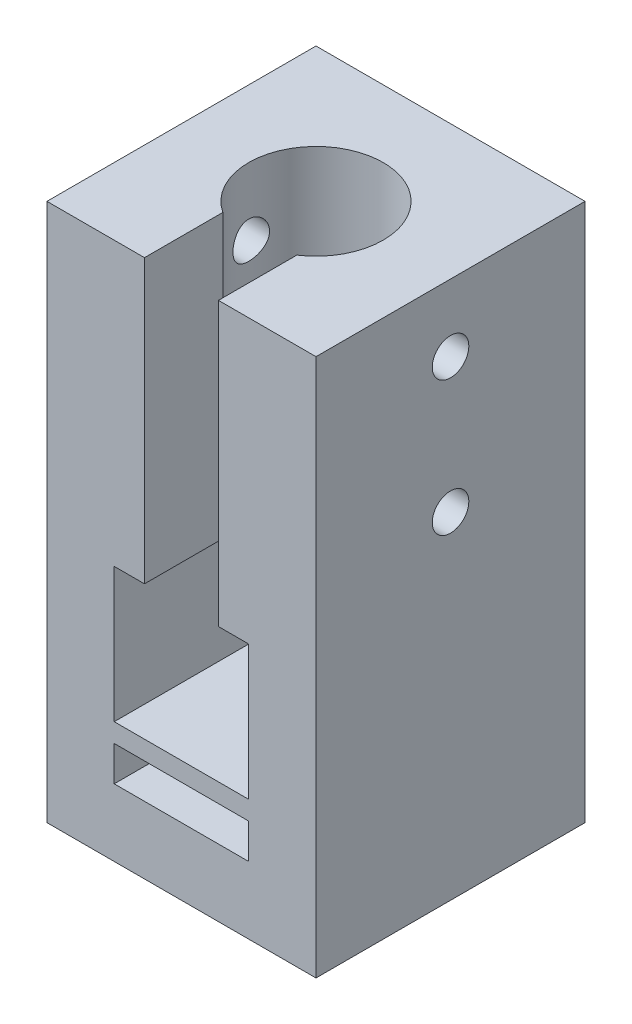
ISO-10303-21;
HEADER;
FILE_DESCRIPTION(('STEP AP214'),'2;1');
FILE_NAME('part.step','',(''),(''),'','','');
FILE_SCHEMA(('AUTOMOTIVE_DESIGN { 1 0 10303 214 1 1 1 1 }'));
ENDSEC;
DATA;
#1=APPLICATION_CONTEXT('core data for automotive mechanical design processes');
#2=APPLICATION_PROTOCOL_DEFINITION('international standard','automotive_design',2000,#1);
#3=PRODUCT_CONTEXT('',#1,'mechanical');
#4=PRODUCT('Part','Part','',(#3));
#5=PRODUCT_RELATED_PRODUCT_CATEGORY('part','',(#4));
#6=PRODUCT_DEFINITION_FORMATION('','',#4);
#7=PRODUCT_DEFINITION_CONTEXT('part definition',#1,'design');
#8=PRODUCT_DEFINITION('design','',#6,#7);
#9=PRODUCT_DEFINITION_SHAPE('','',#8);
#10=(LENGTH_UNIT() NAMED_UNIT(*) SI_UNIT(.MILLI.,.METRE.));
#11=(NAMED_UNIT(*) PLANE_ANGLE_UNIT() SI_UNIT($,.RADIAN.));
#12=(NAMED_UNIT(*) SI_UNIT($,.STERADIAN.) SOLID_ANGLE_UNIT());
#13=UNCERTAINTY_MEASURE_WITH_UNIT(LENGTH_MEASURE(1.E-05),#10,'distance_accuracy_value','');
#14=(GEOMETRIC_REPRESENTATION_CONTEXT(3) GLOBAL_UNCERTAINTY_ASSIGNED_CONTEXT((#13)) GLOBAL_UNIT_ASSIGNED_CONTEXT((#10,
#11,#12)) REPRESENTATION_CONTEXT('',''));
#15=CARTESIAN_POINT('',(0.,0.,0.));
#16=DIRECTION('',(0.,0.,1.));
#17=DIRECTION('',(1.,0.,0.));
#18=AXIS2_PLACEMENT_3D('',#15,#16,#17);
#19=CARTESIAN_POINT('',(-24.9174005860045,6.35,-10.770902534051));
#20=DIRECTION('',(0.,1.,0.));
#21=DIRECTION('',(0.,0.,1.));
#22=AXIS2_PLACEMENT_3D('',#19,#20,#21);
#23=CYLINDRICAL_SURFACE('',#22,3.81);
#24=CARTESIAN_POINT('',(-24.9174005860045,11.43,-10.770902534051));
#25=DIRECTION('',(0.,-1.,0.));
#26=DIRECTION('',(0.,0.,-1.));
#27=AXIS2_PLACEMENT_3D('',#24,#25,#26);
#28=CIRCLE('',#27,3.81);
#29=CARTESIAN_POINT('',(-24.9174005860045,11.43,-14.5809025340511));
#30=VERTEX_POINT('',#29);
#31=EDGE_CURVE('E294',#30,#30,#28,.F.);
#32=ORIENTED_EDGE('',*,*,#31,.T.);
#33=EDGE_LOOP('',(#32));
#34=FACE_BOUND('',#33,.T.);
#35=DIRECTION('',(0.,1.,0.));
#36=VECTOR('',#35,1.);
#37=CARTESIAN_POINT('',(-21.1074005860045,6.35,-10.770902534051));
#38=LINE('',#37,#36);
#39=CARTESIAN_POINT('',(-21.1074005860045,9.652,-10.770902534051));
#40=VERTEX_POINT('',#39);
#41=CARTESIAN_POINT('',(-21.1074005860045,6.35,-10.770902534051));
#42=VERTEX_POINT('',#41);
#43=EDGE_CURVE('E11',#40,#42,#38,.F.);
#44=ORIENTED_EDGE('',*,*,#43,.F.);
#45=CARTESIAN_POINT('',(-24.9174005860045,9.652,-10.770902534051));
#46=DIRECTION('',(0.,1.,0.));
#47=DIRECTION('',(0.,0.,1.));
#48=AXIS2_PLACEMENT_3D('',#45,#46,#47);
#49=CIRCLE('',#48,3.81);
#50=CARTESIAN_POINT('',(-28.7274005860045,9.652,-10.770902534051));
#51=VERTEX_POINT('',#50);
#52=EDGE_CURVE('E52',#40,#51,#49,.F.);
#53=ORIENTED_EDGE('',*,*,#52,.T.);
#54=DIRECTION('',(0.,1.,0.));
#55=VECTOR('',#54,1.);
#56=CARTESIAN_POINT('',(-28.7274005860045,6.35,-10.770902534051));
#57=LINE('',#56,#55);
#58=CARTESIAN_POINT('',(-28.7274005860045,6.35,-10.770902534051));
#59=VERTEX_POINT('',#58);
#60=EDGE_CURVE('E392',#59,#51,#57,.T.);
#61=ORIENTED_EDGE('',*,*,#60,.F.);
#62=CARTESIAN_POINT('',(-24.9174005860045,6.35,-10.770902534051));
#63=DIRECTION('',(0.,1.,0.));
#64=DIRECTION('',(0.,0.,1.));
#65=AXIS2_PLACEMENT_3D('',#62,#63,#64);
#66=CIRCLE('',#65,3.81);
#67=EDGE_CURVE('E193',#42,#59,#66,.T.);
#68=ORIENTED_EDGE('',*,*,#67,.F.);
#69=EDGE_LOOP('',(#44,#53,#61,#68));
#70=FACE_BOUND('',#69,.T.);
#71=ADVANCED_FACE('F43',(#34,#70),#23,.F.);
#72=DIRECTION('',(0.,1.,0.));
#73=VECTOR('',#72,1.);
#74=CARTESIAN_POINT('',(-28.4099005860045,6.35,-9.24822602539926));
#75=LINE('',#74,#73);
#76=CARTESIAN_POINT('',(-28.4099005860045,25.4,-9.24822602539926));
#77=VERTEX_POINT('',#76);
#78=CARTESIAN_POINT('',(-28.4099005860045,24.13,-9.24822602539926));
#79=VERTEX_POINT('',#78);
#80=EDGE_CURVE('E384',#77,#79,#75,.F.);
#81=ORIENTED_EDGE('',*,*,#80,.T.);
#82=CARTESIAN_POINT('',(-24.9174005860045,24.13,-10.770902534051));
#83=DIRECTION('',(0.,1.,0.));
#84=DIRECTION('',(0.,0.,1.));
#85=AXIS2_PLACEMENT_3D('',#82,#83,#84);
#86=CIRCLE('',#85,3.81);
#87=CARTESIAN_POINT('',(-21.4249005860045,24.13,-9.24822602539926));
#88=VERTEX_POINT('',#87);
#89=EDGE_CURVE('E278',#79,#88,#86,.F.);
#90=ORIENTED_EDGE('',*,*,#89,.T.);
#91=DIRECTION('',(0.,1.,0.));
#92=VECTOR('',#91,1.);
#93=CARTESIAN_POINT('',(-21.4249005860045,6.35,-9.24822602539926));
#94=LINE('',#93,#92);
#95=CARTESIAN_POINT('',(-21.4249005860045,25.4,-9.24822602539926));
#96=VERTEX_POINT('',#95);
#97=EDGE_CURVE('E381',#88,#96,#94,.T.);
#98=ORIENTED_EDGE('',*,*,#97,.T.);
#99=CARTESIAN_POINT('',(-24.9174005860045,25.4,-10.770902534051));
#100=DIRECTION('',(0.,1.,0.));
#101=DIRECTION('',(0.,0.,1.));
#102=AXIS2_PLACEMENT_3D('',#99,#100,#101);
#103=CIRCLE('',#102,3.81);
#104=EDGE_CURVE('E323',#96,#77,#103,.T.);
#105=ORIENTED_EDGE('',*,*,#104,.T.);
#106=EDGE_LOOP('',(#81,#90,#98,#105));
#107=FACE_BOUND('',#106,.T.);
#108=ADVANCED_FACE('F467',(#107),#23,.F.);
#109=CARTESIAN_POINT('',(-37.6174005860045,50.8,1.92909746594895));
#110=DIRECTION('',(1.,0.,0.));
#111=DIRECTION('',(0.,0.,-1.));
#112=AXIS2_PLACEMENT_3D('',#109,#110,#111);
#113=PLANE('',#112);
#114=CARTESIAN_POINT('',(-37.6174005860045,44.45,-10.770902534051));
#115=DIRECTION('',(-1.,0.,0.));
#116=DIRECTION('',(0.,0.,1.));
#117=AXIS2_PLACEMENT_3D('',#114,#115,#116);
#118=CIRCLE('',#117,1.72719999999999);
#119=CARTESIAN_POINT('',(-37.6174005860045,44.45,-9.04370253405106));
#120=VERTEX_POINT('',#119);
#121=EDGE_CURVE('E730',#120,#120,#118,.T.);
#122=ORIENTED_EDGE('',*,*,#121,.F.);
#123=EDGE_LOOP('',(#122));
#124=FACE_BOUND('',#123,.T.);
#125=CARTESIAN_POINT('',(-37.6174005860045,31.75,-10.770902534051));
#126=DIRECTION('',(-1.,0.,0.));
#127=DIRECTION('',(0.,0.,1.));
#128=AXIS2_PLACEMENT_3D('',#125,#126,#127);
#129=CIRCLE('',#128,1.72719999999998);
#130=CARTESIAN_POINT('',(-37.6174005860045,31.75,-9.04370253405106));
#131=VERTEX_POINT('',#130);
#132=EDGE_CURVE('E733',#131,#131,#129,.T.);
#133=ORIENTED_EDGE('',*,*,#132,.F.);
#134=EDGE_LOOP('',(#133));
#135=FACE_BOUND('',#134,.T.);
#136=DIRECTION('',(0.,0.,1.));
#137=VECTOR('',#136,1.);
#138=CARTESIAN_POINT('',(-37.6174005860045,0.,1.92909746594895));
#139=LINE('',#138,#137);
#140=CARTESIAN_POINT('',(-37.6174005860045,0.,-23.470902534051));
#141=VERTEX_POINT('',#140);
#142=CARTESIAN_POINT('',(-37.6174005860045,0.,1.92909746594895));
#143=VERTEX_POINT('',#142);
#144=EDGE_CURVE('E334',#141,#143,#139,.T.);
#145=ORIENTED_EDGE('',*,*,#144,.T.);
#146=DIRECTION('',(0.,-1.,0.));
#147=VECTOR('',#146,1.);
#148=CARTESIAN_POINT('',(-37.6174005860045,50.8,1.92909746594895));
#149=LINE('',#148,#147);
#150=CARTESIAN_POINT('',(-37.6174005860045,50.8,1.92909746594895));
#151=VERTEX_POINT('',#150);
#152=EDGE_CURVE('E377',#151,#143,#149,.T.);
#153=ORIENTED_EDGE('',*,*,#152,.F.);
#154=DIRECTION('',(0.,0.,1.));
#155=VECTOR('',#154,1.);
#156=CARTESIAN_POINT('',(-37.6174005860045,50.8,1.92909746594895));
#157=LINE('',#156,#155);
#158=CARTESIAN_POINT('',(-37.6174005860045,50.8,-23.470902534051));
#159=VERTEX_POINT('',#158);
#160=EDGE_CURVE('E338',#159,#151,#157,.T.);
#161=ORIENTED_EDGE('',*,*,#160,.F.);
#162=DIRECTION('',(0.,-1.,0.));
#163=VECTOR('',#162,1.);
#164=CARTESIAN_POINT('',(-37.6174005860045,50.8,-23.470902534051));
#165=LINE('',#164,#163);
#166=EDGE_CURVE('E354',#159,#141,#165,.T.);
#167=ORIENTED_EDGE('',*,*,#166,.T.);
#168=EDGE_LOOP('',(#145,#153,#161,#167));
#169=FACE_BOUND('',#168,.T.);
#170=ADVANCED_FACE('F45',(#124,#135,#169),#113,.F.);
#171=CARTESIAN_POINT('',(-37.6174005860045,50.8,1.92909746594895));
#172=DIRECTION('',(0.,0.,-1.));
#173=DIRECTION('',(-1.,0.,0.));
#174=AXIS2_PLACEMENT_3D('',#171,#172,#173);
#175=PLANE('',#174);
#176=DIRECTION('',(1.,0.,0.));
#177=VECTOR('',#176,1.);
#178=CARTESIAN_POINT('',(-31.2674005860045,6.35,1.92909746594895));
#179=LINE('',#178,#177);
#180=CARTESIAN_POINT('',(-31.2674005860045,6.35,1.92909746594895));
#181=VERTEX_POINT('',#180);
#182=CARTESIAN_POINT('',(-18.5674005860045,6.35,1.92909746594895));
#183=VERTEX_POINT('',#182);
#184=EDGE_CURVE('E227',#181,#183,#179,.T.);
#185=ORIENTED_EDGE('',*,*,#184,.F.);
#186=DIRECTION('',(0.,-1.,0.));
#187=VECTOR('',#186,1.);
#188=CARTESIAN_POINT('',(-31.2674005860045,9.652,1.92909746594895));
#189=LINE('',#188,#187);
#190=CARTESIAN_POINT('',(-31.2674005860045,9.652,1.92909746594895));
#191=VERTEX_POINT('',#190);
#192=EDGE_CURVE('E59',#191,#181,#189,.T.);
#193=ORIENTED_EDGE('',*,*,#192,.F.);
#194=DIRECTION('',(-1.,0.,0.));
#195=VECTOR('',#194,1.);
#196=CARTESIAN_POINT('',(-31.2674005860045,9.652,1.92909746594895));
#197=LINE('',#196,#195);
#198=CARTESIAN_POINT('',(-18.5674005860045,9.652,1.92909746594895));
#199=VERTEX_POINT('',#198);
#200=EDGE_CURVE('E203',#199,#191,#197,.T.);
#201=ORIENTED_EDGE('',*,*,#200,.F.);
#202=DIRECTION('',(0.,1.,0.));
#203=VECTOR('',#202,1.);
#204=CARTESIAN_POINT('',(-18.5674005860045,9.652,1.92909746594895));
#205=LINE('',#204,#203);
#206=EDGE_CURVE('E208',#183,#199,#205,.T.);
#207=ORIENTED_EDGE('',*,*,#206,.F.);
#208=EDGE_LOOP('',(#185,#193,#201,#207));
#209=FACE_BOUND('',#208,.T.);
#210=DIRECTION('',(0.,-1.,0.));
#211=VECTOR('',#210,1.);
#212=CARTESIAN_POINT('',(-31.2674005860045,24.13,1.92909746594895));
#213=LINE('',#212,#211);
#214=CARTESIAN_POINT('',(-31.2674005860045,24.13,1.92909746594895));
#215=VERTEX_POINT('',#214);
#216=CARTESIAN_POINT('',(-31.2674005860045,11.43,1.92909746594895));
#217=VERTEX_POINT('',#216);
#218=EDGE_CURVE('E236',#215,#217,#213,.T.);
#219=ORIENTED_EDGE('',*,*,#218,.F.);
#220=DIRECTION('',(-1.,0.,0.));
#221=VECTOR('',#220,1.);
#222=CARTESIAN_POINT('',(-31.2674005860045,24.13,1.92909746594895));
#223=LINE('',#222,#221);
#224=CARTESIAN_POINT('',(-28.4099005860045,24.13,1.92909746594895));
#225=VERTEX_POINT('',#224);
#226=EDGE_CURVE('E271',#225,#215,#223,.T.);
#227=ORIENTED_EDGE('',*,*,#226,.F.);
#228=DIRECTION('',(0.,1.,0.));
#229=VECTOR('',#228,1.);
#230=CARTESIAN_POINT('',(-28.4099005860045,12.7,1.92909746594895));
#231=LINE('',#230,#229);
#232=CARTESIAN_POINT('',(-28.4099005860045,50.8,1.92909746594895));
#233=VERTEX_POINT('',#232);
#234=EDGE_CURVE('E302',#225,#233,#231,.T.);
#235=ORIENTED_EDGE('',*,*,#234,.T.);
#236=DIRECTION('',(1.,0.,0.));
#237=VECTOR('',#236,1.);
#238=CARTESIAN_POINT('',(-37.6174005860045,50.8,1.92909746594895));
#239=LINE('',#238,#237);
#240=EDGE_CURVE('E344',#151,#233,#239,.T.);
#241=ORIENTED_EDGE('',*,*,#240,.F.);
#242=ORIENTED_EDGE('',*,*,#152,.T.);
#243=DIRECTION('',(1.,0.,0.));
#244=VECTOR('',#243,1.);
#245=CARTESIAN_POINT('',(-37.6174005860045,0.,1.92909746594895));
#246=LINE('',#245,#244);
#247=CARTESIAN_POINT('',(-12.2174005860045,0.,1.92909746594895));
#248=VERTEX_POINT('',#247);
#249=EDGE_CURVE('E358',#143,#248,#246,.T.);
#250=ORIENTED_EDGE('',*,*,#249,.T.);
#251=DIRECTION('',(0.,-1.,0.));
#252=VECTOR('',#251,1.);
#253=CARTESIAN_POINT('',(-12.2174005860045,50.8,1.92909746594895));
#254=LINE('',#253,#252);
#255=CARTESIAN_POINT('',(-12.2174005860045,50.8,1.92909746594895));
#256=VERTEX_POINT('',#255);
#257=EDGE_CURVE('E373',#256,#248,#254,.T.);
#258=ORIENTED_EDGE('',*,*,#257,.F.);
#259=CARTESIAN_POINT('',(-21.4249005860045,50.8,1.92909746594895));
#260=VERTEX_POINT('',#259);
#261=EDGE_CURVE('E342',#260,#256,#239,.T.);
#262=ORIENTED_EDGE('',*,*,#261,.F.);
#263=DIRECTION('',(0.,1.,0.));
#264=VECTOR('',#263,1.);
#265=CARTESIAN_POINT('',(-21.4249005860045,12.7,1.92909746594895));
#266=LINE('',#265,#264);
#267=CARTESIAN_POINT('',(-21.4249005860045,24.13,1.92909746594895));
#268=VERTEX_POINT('',#267);
#269=EDGE_CURVE('E303',#268,#260,#266,.T.);
#270=ORIENTED_EDGE('',*,*,#269,.F.);
#271=CARTESIAN_POINT('',(-18.5674005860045,24.13,1.92909746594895));
#272=VERTEX_POINT('',#271);
#273=EDGE_CURVE('E247',#272,#268,#223,.T.);
#274=ORIENTED_EDGE('',*,*,#273,.F.);
#275=DIRECTION('',(0.,1.,0.));
#276=VECTOR('',#275,1.);
#277=CARTESIAN_POINT('',(-18.5674005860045,24.13,1.92909746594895));
#278=LINE('',#277,#276);
#279=CARTESIAN_POINT('',(-18.5674005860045,11.43,1.92909746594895));
#280=VERTEX_POINT('',#279);
#281=EDGE_CURVE('E267',#280,#272,#278,.T.);
#282=ORIENTED_EDGE('',*,*,#281,.F.);
#283=DIRECTION('',(1.,0.,0.));
#284=VECTOR('',#283,1.);
#285=CARTESIAN_POINT('',(-31.2674005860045,11.43,1.92909746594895));
#286=LINE('',#285,#284);
#287=EDGE_CURVE('E263',#217,#280,#286,.T.);
#288=ORIENTED_EDGE('',*,*,#287,.F.);
#289=EDGE_LOOP('',(#219,#227,#235,#241,#242,#250,#258,#262,#270,#274,#282,#288));
#290=FACE_BOUND('',#289,.T.);
#291=ADVANCED_FACE('F413',(#209,#290),#175,.F.);
#292=CARTESIAN_POINT('',(-12.2174005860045,50.8,1.92909746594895));
#293=DIRECTION('',(-1.,0.,0.));
#294=DIRECTION('',(0.,0.,1.));
#295=AXIS2_PLACEMENT_3D('',#292,#293,#294);
#296=PLANE('',#295);
#297=CARTESIAN_POINT('',(-12.2174005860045,44.45,-10.770902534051));
#298=DIRECTION('',(1.,0.,0.));
#299=DIRECTION('',(0.,0.,-1.));
#300=AXIS2_PLACEMENT_3D('',#297,#298,#299);
#301=CIRCLE('',#300,1.72719999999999);
#302=CARTESIAN_POINT('',(-12.2174005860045,44.45,-12.498102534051));
#303=VERTEX_POINT('',#302);
#304=EDGE_CURVE('E742',#303,#303,#301,.T.);
#305=ORIENTED_EDGE('',*,*,#304,.F.);
#306=EDGE_LOOP('',(#305));
#307=FACE_BOUND('',#306,.T.);
#308=CARTESIAN_POINT('',(-12.2174005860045,31.75,-10.770902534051));
#309=DIRECTION('',(1.,0.,0.));
#310=DIRECTION('',(0.,0.,-1.));
#311=AXIS2_PLACEMENT_3D('',#308,#309,#310);
#312=CIRCLE('',#311,1.72719999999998);
#313=CARTESIAN_POINT('',(-12.2174005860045,31.75,-12.498102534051));
#314=VERTEX_POINT('',#313);
#315=EDGE_CURVE('E762',#314,#314,#312,.T.);
#316=ORIENTED_EDGE('',*,*,#315,.F.);
#317=EDGE_LOOP('',(#316));
#318=FACE_BOUND('',#317,.T.);
#319=DIRECTION('',(0.,0.,-1.));
#320=VECTOR('',#319,1.);
#321=CARTESIAN_POINT('',(-12.2174005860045,0.,1.92909746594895));
#322=LINE('',#321,#320);
#323=CARTESIAN_POINT('',(-12.2174005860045,0.,-23.470902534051));
#324=VERTEX_POINT('',#323);
#325=EDGE_CURVE('E361',#248,#324,#322,.T.);
#326=ORIENTED_EDGE('',*,*,#325,.T.);
#327=DIRECTION('',(0.,-1.,0.));
#328=VECTOR('',#327,1.);
#329=CARTESIAN_POINT('',(-12.2174005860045,50.8,-23.470902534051));
#330=LINE('',#329,#328);
#331=CARTESIAN_POINT('',(-12.2174005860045,50.8,-23.470902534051));
#332=VERTEX_POINT('',#331);
#333=EDGE_CURVE('E369',#332,#324,#330,.T.);
#334=ORIENTED_EDGE('',*,*,#333,.F.);
#335=DIRECTION('',(0.,0.,-1.));
#336=VECTOR('',#335,1.);
#337=CARTESIAN_POINT('',(-12.2174005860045,50.8,1.92909746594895));
#338=LINE('',#337,#336);
#339=EDGE_CURVE('E348',#256,#332,#338,.T.);
#340=ORIENTED_EDGE('',*,*,#339,.F.);
#341=ORIENTED_EDGE('',*,*,#257,.T.);
#342=EDGE_LOOP('',(#326,#334,#340,#341));
#343=FACE_BOUND('',#342,.T.);
#344=ADVANCED_FACE('F416',(#307,#318,#343),#296,.F.);
#345=CARTESIAN_POINT('',(-37.6174005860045,50.8,-23.470902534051));
#346=DIRECTION('',(0.,0.,1.));
#347=DIRECTION('',(1.,0.,0.));
#348=AXIS2_PLACEMENT_3D('',#345,#346,#347);
#349=PLANE('',#348);
#350=DIRECTION('',(-1.,0.,0.));
#351=VECTOR('',#350,1.);
#352=CARTESIAN_POINT('',(-31.2674005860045,24.13,-23.470902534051));
#353=LINE('',#352,#351);
#354=CARTESIAN_POINT('',(-18.5674005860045,24.13,-23.470902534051));
#355=VERTEX_POINT('',#354);
#356=CARTESIAN_POINT('',(-31.2674005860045,24.13,-23.470902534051));
#357=VERTEX_POINT('',#356);
#358=EDGE_CURVE('E255',#355,#357,#353,.T.);
#359=ORIENTED_EDGE('',*,*,#358,.T.);
#360=DIRECTION('',(0.,-1.,0.));
#361=VECTOR('',#360,1.);
#362=CARTESIAN_POINT('',(-31.2674005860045,24.13,-23.470902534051));
#363=LINE('',#362,#361);
#364=CARTESIAN_POINT('',(-31.2674005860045,11.43,-23.470902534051));
#365=VERTEX_POINT('',#364);
#366=EDGE_CURVE('E242',#357,#365,#363,.T.);
#367=ORIENTED_EDGE('',*,*,#366,.T.);
#368=DIRECTION('',(1.,0.,0.));
#369=VECTOR('',#368,1.);
#370=CARTESIAN_POINT('',(-31.2674005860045,11.43,-23.470902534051));
#371=LINE('',#370,#369);
#372=CARTESIAN_POINT('',(-18.5674005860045,11.43,-23.470902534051));
#373=VERTEX_POINT('',#372);
#374=EDGE_CURVE('E246',#365,#373,#371,.T.);
#375=ORIENTED_EDGE('',*,*,#374,.T.);
#376=DIRECTION('',(0.,1.,0.));
#377=VECTOR('',#376,1.);
#378=CARTESIAN_POINT('',(-18.5674005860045,24.13,-23.470902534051));
#379=LINE('',#378,#377);
#380=EDGE_CURVE('E251',#373,#355,#379,.T.);
#381=ORIENTED_EDGE('',*,*,#380,.T.);
#382=EDGE_LOOP('',(#359,#367,#375,#381));
#383=FACE_BOUND('',#382,.T.);
#384=DIRECTION('',(-1.,0.,0.));
#385=VECTOR('',#384,1.);
#386=CARTESIAN_POINT('',(-37.6174005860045,0.,-23.470902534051));
#387=LINE('',#386,#385);
#388=EDGE_CURVE('E343',#324,#141,#387,.T.);
#389=ORIENTED_EDGE('',*,*,#388,.T.);
#390=ORIENTED_EDGE('',*,*,#166,.F.);
#391=DIRECTION('',(-1.,0.,0.));
#392=VECTOR('',#391,1.);
#393=CARTESIAN_POINT('',(-37.6174005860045,50.8,-23.470902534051));
#394=LINE('',#393,#392);
#395=EDGE_CURVE('E351',#332,#159,#394,.T.);
#396=ORIENTED_EDGE('',*,*,#395,.F.);
#397=ORIENTED_EDGE('',*,*,#333,.T.);
#398=EDGE_LOOP('',(#389,#390,#396,#397));
#399=FACE_BOUND('',#398,.T.);
#400=ADVANCED_FACE('F447',(#383,#399),#349,.F.);
#401=CARTESIAN_POINT('',(0.,50.8,0.));
#402=DIRECTION('',(0.,-1.,0.));
#403=DIRECTION('',(0.,0.,-1.));
#404=AXIS2_PLACEMENT_3D('',#401,#402,#403);
#405=PLANE('',#404);
#406=ORIENTED_EDGE('',*,*,#240,.T.);
#407=DIRECTION('',(0.,0.,1.));
#408=VECTOR('',#407,1.);
#409=CARTESIAN_POINT('',(-28.4099005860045,50.8,1.92909746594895));
#410=LINE('',#409,#408);
#411=CARTESIAN_POINT('',(-28.4099005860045,50.8,-5.46760697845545));
#412=VERTEX_POINT('',#411);
#413=EDGE_CURVE('E295',#412,#233,#410,.T.);
#414=ORIENTED_EDGE('',*,*,#413,.F.);
#415=CARTESIAN_POINT('',(-24.9174005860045,50.8,-10.770902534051));
#416=DIRECTION('',(0.,1.,0.));
#417=DIRECTION('',(0.,0.,1.));
#418=AXIS2_PLACEMENT_3D('',#415,#416,#417);
#419=CIRCLE('',#418,6.35);
#420=CARTESIAN_POINT('',(-21.4249005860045,50.8,-5.46760697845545));
#421=VERTEX_POINT('',#420);
#422=EDGE_CURVE('E326',#421,#412,#419,.T.);
#423=ORIENTED_EDGE('',*,*,#422,.F.);
#424=DIRECTION('',(0.,0.,-1.));
#425=VECTOR('',#424,1.);
#426=CARTESIAN_POINT('',(-21.4249005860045,50.8,1.92909746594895));
#427=LINE('',#426,#425);
#428=EDGE_CURVE('E299',#260,#421,#427,.T.);
#429=ORIENTED_EDGE('',*,*,#428,.F.);
#430=ORIENTED_EDGE('',*,*,#261,.T.);
#431=ORIENTED_EDGE('',*,*,#339,.T.);
#432=ORIENTED_EDGE('',*,*,#395,.T.);
#433=ORIENTED_EDGE('',*,*,#160,.T.);
#434=EDGE_LOOP('',(#406,#414,#423,#429,#430,#431,#432,#433));
#435=FACE_BOUND('',#434,.T.);
#436=ADVANCED_FACE('F436',(#435),#405,.F.);
#437=CARTESIAN_POINT('',(0.,0.,0.));
#438=DIRECTION('',(0.,-1.,0.));
#439=DIRECTION('',(0.,0.,-1.));
#440=AXIS2_PLACEMENT_3D('',#437,#438,#439);
#441=PLANE('',#440);
#442=ORIENTED_EDGE('',*,*,#144,.F.);
#443=ORIENTED_EDGE('',*,*,#388,.F.);
#444=ORIENTED_EDGE('',*,*,#325,.F.);
#445=ORIENTED_EDGE('',*,*,#249,.F.);
#446=EDGE_LOOP('',(#442,#443,#444,#445));
#447=FACE_BOUND('',#446,.T.);
#448=ADVANCED_FACE('F482',(#447),#441,.T.);
#449=CARTESIAN_POINT('',(-24.9174005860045,25.4,-10.770902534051));
#450=DIRECTION('',(0.,1.,0.));
#451=DIRECTION('',(0.,0.,1.));
#452=AXIS2_PLACEMENT_3D('',#449,#450,#451);
#453=CYLINDRICAL_SURFACE('',#452,6.35);
#454=CARTESIAN_POINT('',(-31.0279881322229,44.45,-9.04370253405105));
#455=CARTESIAN_POINT('',(-31.0279897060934,44.3549284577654,-9.04370467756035));
#456=CARTESIAN_POINT('',(-31.0302311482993,44.2598345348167,-9.05157891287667));
#457=CARTESIAN_POINT('',(-31.0389265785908,44.0723981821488,-9.08280488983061));
#458=CARTESIAN_POINT('',(-31.0453825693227,43.9800570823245,-9.10616398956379));
#459=CARTESIAN_POINT('',(-31.0617230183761,43.8008651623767,-9.16753086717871));
#460=CARTESIAN_POINT('',(-31.0716025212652,43.7140066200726,-9.20551748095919));
#461=CARTESIAN_POINT('',(-31.0936704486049,43.5478804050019,-9.29499423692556));
#462=CARTESIAN_POINT('',(-31.1058590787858,43.4686134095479,-9.34648558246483));
#463=CARTESIAN_POINT('',(-31.1315273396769,43.3178578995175,-9.4629431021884));
#464=CARTESIAN_POINT('',(-31.1450305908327,43.246596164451,-9.52819770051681));
#465=CARTESIAN_POINT('',(-31.171603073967,43.1158810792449,-9.6697094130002));
#466=CARTESIAN_POINT('',(-31.1846722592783,43.0564289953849,-9.74596770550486));
#467=CARTESIAN_POINT('',(-31.2091683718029,42.9500692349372,-9.90890085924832));
#468=CARTESIAN_POINT('',(-31.220564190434,42.9033878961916,-9.99572855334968));
#469=CARTESIAN_POINT('',(-31.2401580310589,42.8253723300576,-10.1763620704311));
#470=CARTESIAN_POINT('',(-31.2483566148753,42.7940354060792,-10.2701666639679));
#471=CARTESIAN_POINT('',(-31.2604651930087,42.7483346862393,-10.4597232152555));
#472=CARTESIAN_POINT('',(-31.2644725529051,42.7335849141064,-10.5553757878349));
#473=CARTESIAN_POINT('',(-31.2680879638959,42.7202619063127,-10.7478760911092));
#474=CARTESIAN_POINT('',(-31.267696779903,42.7216858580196,-10.8447236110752));
#475=CARTESIAN_POINT('',(-31.2626301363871,42.7404000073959,-11.0341748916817));
#476=CARTESIAN_POINT('',(-31.258067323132,42.7572730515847,-11.1268233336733));
#477=CARTESIAN_POINT('',(-31.2453036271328,42.8057313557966,-11.3079205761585));
#478=CARTESIAN_POINT('',(-31.2371025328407,42.837317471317,-11.3963691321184));
#479=CARTESIAN_POINT('',(-31.2178184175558,42.914619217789,-11.5676095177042));
#480=CARTESIAN_POINT('',(-31.2067067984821,42.9604759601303,-11.6503342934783));
#481=CARTESIAN_POINT('',(-31.182796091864,43.0649084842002,-11.807055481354));
#482=CARTESIAN_POINT('',(-31.1699966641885,43.1234868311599,-11.8810501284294));
#483=CARTESIAN_POINT('',(-31.1436129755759,43.2539066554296,-12.0207008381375));
#484=CARTESIAN_POINT('',(-31.1300167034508,43.3261116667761,-12.0860155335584));
#485=CARTESIAN_POINT('',(-31.1039384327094,43.4805898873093,-12.2036943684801));
#486=CARTESIAN_POINT('',(-31.0914565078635,43.5628637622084,-12.2560576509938));
#487=CARTESIAN_POINT('',(-31.0689704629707,43.7359083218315,-12.3466212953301));
#488=CARTESIAN_POINT('',(-31.0589833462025,43.8267317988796,-12.3847253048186));
#489=CARTESIAN_POINT('',(-31.0428271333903,44.0138359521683,-12.4450096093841));
#490=CARTESIAN_POINT('',(-31.0366570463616,44.110115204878,-12.4671940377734));
#491=CARTESIAN_POINT('',(-31.0290456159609,44.3021965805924,-12.4944134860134));
#492=CARTESIAN_POINT('',(-31.0274635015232,44.3979208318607,-12.499959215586));
#493=CARTESIAN_POINT('',(-31.0288213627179,44.5889296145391,-12.4951538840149));
#494=CARTESIAN_POINT('',(-31.0317608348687,44.6842141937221,-12.484804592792));
#495=CARTESIAN_POINT('',(-31.0416943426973,44.869646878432,-12.4489539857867));
#496=CARTESIAN_POINT('',(-31.048605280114,44.9598598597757,-12.4237629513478));
#497=CARTESIAN_POINT('',(-31.0656210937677,45.1347792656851,-12.359294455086));
#498=CARTESIAN_POINT('',(-31.0757263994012,45.2194849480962,-12.3200150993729));
#499=CARTESIAN_POINT('',(-31.0982788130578,45.3831129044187,-12.2274586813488));
#500=CARTESIAN_POINT('',(-31.1107739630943,45.4618597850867,-12.1738835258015));
#501=CARTESIAN_POINT('',(-31.1365867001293,45.6094330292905,-12.0546234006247));
#502=CARTESIAN_POINT('',(-31.1499044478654,45.6782574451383,-11.9889360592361));
#503=CARTESIAN_POINT('',(-31.1763489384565,45.8061693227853,-11.8449479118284));
#504=CARTESIAN_POINT('',(-31.1894577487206,45.8648997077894,-11.7663259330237));
#505=CARTESIAN_POINT('',(-31.2135955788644,45.9683308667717,-11.6000442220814));
#506=CARTESIAN_POINT('',(-31.2246247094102,46.0130323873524,-11.5123849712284));
#507=CARTESIAN_POINT('',(-31.2432893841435,46.0867209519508,-11.3311337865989));
#508=CARTESIAN_POINT('',(-31.2509503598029,46.1158261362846,-11.2375926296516));
#509=CARTESIAN_POINT('',(-31.262127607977,46.1578338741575,-11.0467065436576));
#510=CARTESIAN_POINT('',(-31.2656448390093,46.1707401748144,-10.949362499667));
#511=CARTESIAN_POINT('',(-31.2680910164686,46.1797411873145,-10.7569639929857));
#512=CARTESIAN_POINT('',(-31.2671626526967,46.1763586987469,-10.6619354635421));
#513=CARTESIAN_POINT('',(-31.2611467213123,46.1540975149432,-10.4738529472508));
#514=CARTESIAN_POINT('',(-31.256059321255,46.1352194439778,-10.3807988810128));
#515=CARTESIAN_POINT('',(-31.2423272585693,46.0828032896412,-10.1999625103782));
#516=CARTESIAN_POINT('',(-31.2337092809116,46.0493750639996,-10.1121462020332));
#517=CARTESIAN_POINT('',(-31.2138153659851,45.9689053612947,-9.94331888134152));
#518=CARTESIAN_POINT('',(-31.2025390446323,45.9218619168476,-9.8623088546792));
#519=CARTESIAN_POINT('',(-31.1781445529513,45.813988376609,-9.70697522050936));
#520=CARTESIAN_POINT('',(-31.1649842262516,45.7528144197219,-9.63289705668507));
#521=CARTESIAN_POINT('',(-31.1384696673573,45.6190634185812,-9.49588100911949));
#522=CARTESIAN_POINT('',(-31.1251153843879,45.5464833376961,-9.43294610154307));
#523=CARTESIAN_POINT('',(-31.0993678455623,45.3899605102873,-9.31855778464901));
#524=CARTESIAN_POINT('',(-31.0870039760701,45.3057937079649,-9.26740373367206));
#525=CARTESIAN_POINT('',(-31.0650594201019,45.1297283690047,-9.18004335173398));
#526=CARTESIAN_POINT('',(-31.0554769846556,45.0378347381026,-9.14382762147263));
#527=CARTESIAN_POINT('',(-31.0414538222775,44.8636202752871,-9.09189235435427));
#528=CARTESIAN_POINT('',(-31.0364460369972,44.7820261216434,-9.07386466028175));
#529=CARTESIAN_POINT('',(-31.0297127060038,44.6169602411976,-9.04976955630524));
#530=CARTESIAN_POINT('',(-31.0279867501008,44.5334887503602,-9.04370065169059));
#531=CARTESIAN_POINT('',(-31.0279881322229,44.45,-9.04370253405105));
#532=B_SPLINE_CURVE_WITH_KNOTS('',3,(#454,#455,#456,#457,#458,#459,#460,#461,#462,#463,#464,
#465,#466,#467,#468,#469,#470,#471,#472,#473,#474,#475,#476,#477,#478,#479,#480,#481,#482,#483,
#484,#485,#486,#487,#488,#489,#490,#491,#492,#493,#494,#495,#496,#497,#498,#499,#500,#501,#502,
#503,#504,#505,#506,#507,#508,#509,#510,#511,#512,#513,#514,#515,#516,#517,#518,#519,#520,#521,
#522,#523,#524,#525,#526,#527,#528,#529,#530,#531),.UNSPECIFIED.,.T.,.F.,(4,2,2,2,2,2,2,2,2,2,2,
2,2,2,2,2,2,2,2,2,2,2,2,2,2,2,2,2,2,2,2,2,2,2,2,2,2,2,4),(0.,0.284907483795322,
0.569950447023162,0.854582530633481,1.13923998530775,1.4305920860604,1.72197540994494,
2.01823016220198,2.31443283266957,2.60359035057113,2.89269758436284,3.17422149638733,
3.45576177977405,3.74017954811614,4.02465472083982,4.31820614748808,4.6117769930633,
4.90729718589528,5.20274062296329,5.48901787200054,5.77526324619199,6.05572669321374,
6.33622785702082,6.62310984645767,6.91004807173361,7.20565699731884,7.50125018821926,
7.79457145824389,8.08782486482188,8.37173002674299,8.6556237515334,8.9374102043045,
9.21923739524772,9.50882250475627,9.79848484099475,10.0948495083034,10.3910274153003,
10.641255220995,10.8914517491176),.UNSPECIFIED.);
#533=CARTESIAN_POINT('',(-31.0279881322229,44.45,-9.04370253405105));
#534=VERTEX_POINT('',#533);
#535=EDGE_CURVE('E737',#534,#534,#532,.T.);
#536=ORIENTED_EDGE('',*,*,#535,.F.);
#537=EDGE_LOOP('',(#536));
#538=FACE_BOUND('',#537,.T.);
#539=CARTESIAN_POINT('',(-31.0279881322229,31.75,-9.04370253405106));
#540=CARTESIAN_POINT('',(-31.0279897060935,31.6549284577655,-9.04370467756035));
#541=CARTESIAN_POINT('',(-31.0302311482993,31.5598345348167,-9.05157891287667));
#542=CARTESIAN_POINT('',(-31.0389265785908,31.3723981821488,-9.08280488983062));
#543=CARTESIAN_POINT('',(-31.0453825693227,31.2800570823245,-9.10616398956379));
#544=CARTESIAN_POINT('',(-31.0617230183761,31.1008651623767,-9.16753086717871));
#545=CARTESIAN_POINT('',(-31.0716025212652,31.0140066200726,-9.20551748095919));
#546=CARTESIAN_POINT('',(-31.0936704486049,30.8478804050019,-9.29499423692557));
#547=CARTESIAN_POINT('',(-31.1058590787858,30.7686134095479,-9.34648558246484));
#548=CARTESIAN_POINT('',(-31.1315273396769,30.6178578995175,-9.4629431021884));
#549=CARTESIAN_POINT('',(-31.1450305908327,30.546596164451,-9.52819770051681));
#550=CARTESIAN_POINT('',(-31.171603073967,30.4158810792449,-9.6697094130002));
#551=CARTESIAN_POINT('',(-31.1846722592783,30.3564289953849,-9.74596770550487));
#552=CARTESIAN_POINT('',(-31.2091683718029,30.2500692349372,-9.90890085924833));
#553=CARTESIAN_POINT('',(-31.220564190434,30.2033878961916,-9.99572855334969));
#554=CARTESIAN_POINT('',(-31.2401580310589,30.1253723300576,-10.1763620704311));
#555=CARTESIAN_POINT('',(-31.2483566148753,30.0940354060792,-10.2701666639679));
#556=CARTESIAN_POINT('',(-31.2604651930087,30.0483346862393,-10.4597232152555));
#557=CARTESIAN_POINT('',(-31.2644725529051,30.0335849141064,-10.5553757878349));
#558=CARTESIAN_POINT('',(-31.2680879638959,30.0202619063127,-10.7478760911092));
#559=CARTESIAN_POINT('',(-31.267696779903,30.0216858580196,-10.8447236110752));
#560=CARTESIAN_POINT('',(-31.2626301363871,30.0404000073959,-11.0341748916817));
#561=CARTESIAN_POINT('',(-31.258067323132,30.0572730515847,-11.1268233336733));
#562=CARTESIAN_POINT('',(-31.2453036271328,30.1057313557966,-11.3079205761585));
#563=CARTESIAN_POINT('',(-31.2371025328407,30.137317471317,-11.3963691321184));
#564=CARTESIAN_POINT('',(-31.2178184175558,30.214619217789,-11.5676095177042));
#565=CARTESIAN_POINT('',(-31.2067067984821,30.2604759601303,-11.6503342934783));
#566=CARTESIAN_POINT('',(-31.182796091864,30.3649084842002,-11.807055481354));
#567=CARTESIAN_POINT('',(-31.1699966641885,30.4234868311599,-11.8810501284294));
#568=CARTESIAN_POINT('',(-31.1436129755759,30.5539066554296,-12.0207008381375));
#569=CARTESIAN_POINT('',(-31.1300167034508,30.6261116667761,-12.0860155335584));
#570=CARTESIAN_POINT('',(-31.1039384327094,30.7805898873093,-12.2036943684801));
#571=CARTESIAN_POINT('',(-31.0914565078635,30.8628637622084,-12.2560576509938));
#572=CARTESIAN_POINT('',(-31.0689704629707,31.0359083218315,-12.3466212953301));
#573=CARTESIAN_POINT('',(-31.0589833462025,31.1267317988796,-12.3847253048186));
#574=CARTESIAN_POINT('',(-31.0428271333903,31.3138359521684,-12.4450096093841));
#575=CARTESIAN_POINT('',(-31.0366570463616,31.410115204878,-12.4671940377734));
#576=CARTESIAN_POINT('',(-31.0290456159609,31.6021965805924,-12.4944134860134));
#577=CARTESIAN_POINT('',(-31.0274635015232,31.6979208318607,-12.499959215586));
#578=CARTESIAN_POINT('',(-31.0288213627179,31.8889296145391,-12.4951538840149));
#579=CARTESIAN_POINT('',(-31.0317608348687,31.9842141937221,-12.484804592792));
#580=CARTESIAN_POINT('',(-31.0416943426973,32.169646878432,-12.4489539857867));
#581=CARTESIAN_POINT('',(-31.048605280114,32.2598598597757,-12.4237629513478));
#582=CARTESIAN_POINT('',(-31.0656210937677,32.4347792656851,-12.359294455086));
#583=CARTESIAN_POINT('',(-31.0757263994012,32.5194849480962,-12.3200150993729));
#584=CARTESIAN_POINT('',(-31.0982788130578,32.6831129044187,-12.2274586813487));
#585=CARTESIAN_POINT('',(-31.1107739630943,32.7618597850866,-12.1738835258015));
#586=CARTESIAN_POINT('',(-31.1365867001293,32.9094330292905,-12.0546234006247));
#587=CARTESIAN_POINT('',(-31.1499044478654,32.9782574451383,-11.9889360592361));
#588=CARTESIAN_POINT('',(-31.1763489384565,33.1061693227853,-11.8449479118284));
#589=CARTESIAN_POINT('',(-31.1894577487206,33.1648997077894,-11.7663259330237));
#590=CARTESIAN_POINT('',(-31.2135955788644,33.2683308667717,-11.6000442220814));
#591=CARTESIAN_POINT('',(-31.2246247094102,33.3130323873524,-11.5123849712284));
#592=CARTESIAN_POINT('',(-31.2432893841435,33.3867209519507,-11.3311337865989));
#593=CARTESIAN_POINT('',(-31.2509503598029,33.4158261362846,-11.2375926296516));
#594=CARTESIAN_POINT('',(-31.262127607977,33.4578338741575,-11.0467065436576));
#595=CARTESIAN_POINT('',(-31.2656448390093,33.4707401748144,-10.949362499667));
#596=CARTESIAN_POINT('',(-31.2680910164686,33.4797411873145,-10.7569639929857));
#597=CARTESIAN_POINT('',(-31.2671626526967,33.4763586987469,-10.6619354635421));
#598=CARTESIAN_POINT('',(-31.2611467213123,33.4540975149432,-10.4738529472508));
#599=CARTESIAN_POINT('',(-31.256059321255,33.4352194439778,-10.3807988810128));
#600=CARTESIAN_POINT('',(-31.2423272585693,33.3828032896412,-10.1999625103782));
#601=CARTESIAN_POINT('',(-31.2337092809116,33.3493750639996,-10.1121462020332));
#602=CARTESIAN_POINT('',(-31.2138153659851,33.2689053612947,-9.94331888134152));
#603=CARTESIAN_POINT('',(-31.2025390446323,33.2218619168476,-9.8623088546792));
#604=CARTESIAN_POINT('',(-31.1781445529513,33.113988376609,-9.70697522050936));
#605=CARTESIAN_POINT('',(-31.1649842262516,33.0528144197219,-9.63289705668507));
#606=CARTESIAN_POINT('',(-31.1384696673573,32.9190634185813,-9.49588100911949));
#607=CARTESIAN_POINT('',(-31.1251153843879,32.8464833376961,-9.43294610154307));
#608=CARTESIAN_POINT('',(-31.0993678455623,32.6899605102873,-9.31855778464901));
#609=CARTESIAN_POINT('',(-31.0870039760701,32.6057937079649,-9.26740373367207));
#610=CARTESIAN_POINT('',(-31.0650594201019,32.4297283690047,-9.18004335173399));
#611=CARTESIAN_POINT('',(-31.0554769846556,32.3378347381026,-9.14382762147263));
#612=CARTESIAN_POINT('',(-31.0414538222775,32.1636202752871,-9.09189235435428));
#613=CARTESIAN_POINT('',(-31.0364460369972,32.0820261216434,-9.07386466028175));
#614=CARTESIAN_POINT('',(-31.0297127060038,31.9169602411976,-9.04976955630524));
#615=CARTESIAN_POINT('',(-31.0279867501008,31.8334887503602,-9.0437006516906));
#616=CARTESIAN_POINT('',(-31.0279881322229,31.75,-9.04370253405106));
#617=B_SPLINE_CURVE_WITH_KNOTS('',3,(#539,#540,#541,#542,#543,#544,#545,#546,#547,#548,#549,
#550,#551,#552,#553,#554,#555,#556,#557,#558,#559,#560,#561,#562,#563,#564,#565,#566,#567,#568,
#569,#570,#571,#572,#573,#574,#575,#576,#577,#578,#579,#580,#581,#582,#583,#584,#585,#586,#587,
#588,#589,#590,#591,#592,#593,#594,#595,#596,#597,#598,#599,#600,#601,#602,#603,#604,#605,#606,
#607,#608,#609,#610,#611,#612,#613,#614,#615,#616),.UNSPECIFIED.,.T.,.F.,(4,2,2,2,2,2,2,2,2,2,2,
2,2,2,2,2,2,2,2,2,2,2,2,2,2,2,2,2,2,2,2,2,2,2,2,2,2,2,4),(0.,0.284907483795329,
0.569950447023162,0.854582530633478,1.13923998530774,1.4305920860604,1.72197540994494,
2.01823016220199,2.31443283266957,2.60359035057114,2.89269758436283,3.17422149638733,
3.45576177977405,3.74017954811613,4.02465472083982,4.31820614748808,4.6117769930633,
4.90729718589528,5.20274062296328,5.48901787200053,5.77526324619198,6.05572669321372,
6.3362278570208,6.62310984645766,6.9100480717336,7.20565699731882,7.50125018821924,
7.79457145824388,8.08782486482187,8.37173002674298,8.65562375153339,8.93741020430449,
9.2192373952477,9.50882250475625,9.79848484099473,10.0948495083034,10.3910274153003,
10.641255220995,10.8914517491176),.UNSPECIFIED.);
#618=CARTESIAN_POINT('',(-31.0279881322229,31.75,-9.04370253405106));
#619=VERTEX_POINT('',#618);
#620=EDGE_CURVE('E736',#619,#619,#617,.T.);
#621=ORIENTED_EDGE('',*,*,#620,.F.);
#622=EDGE_LOOP('',(#621));
#623=FACE_BOUND('',#622,.T.);
#624=CARTESIAN_POINT('',(-18.806813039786,44.45,-12.498102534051));
#625=CARTESIAN_POINT('',(-18.8068114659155,44.5450715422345,-12.4981003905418));
#626=CARTESIAN_POINT('',(-18.8045700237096,44.6401654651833,-12.4902261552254));
#627=CARTESIAN_POINT('',(-18.7958745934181,44.8276018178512,-12.4590001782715));
#628=CARTESIAN_POINT('',(-18.7894186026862,44.9199429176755,-12.4356410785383));
#629=CARTESIAN_POINT('',(-18.7730781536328,45.0991348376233,-12.3742742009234));
#630=CARTESIAN_POINT('',(-18.7631986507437,45.1859933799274,-12.3362875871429));
#631=CARTESIAN_POINT('',(-18.741130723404,45.3521195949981,-12.2468108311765));
#632=CARTESIAN_POINT('',(-18.7289420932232,45.4313865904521,-12.1953194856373));
#633=CARTESIAN_POINT('',(-18.703273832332,45.5821421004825,-12.0788619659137));
#634=CARTESIAN_POINT('',(-18.6897705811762,45.653403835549,-12.0136073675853));
#635=CARTESIAN_POINT('',(-18.6631980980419,45.7841189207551,-11.8720956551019));
#636=CARTESIAN_POINT('',(-18.6501289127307,45.8435710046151,-11.7958373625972));
#637=CARTESIAN_POINT('',(-18.625632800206,45.9499307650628,-11.6329042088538));
#638=CARTESIAN_POINT('',(-18.6142369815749,45.9966121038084,-11.5460765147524));
#639=CARTESIAN_POINT('',(-18.59464314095,46.0746276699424,-11.365442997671));
#640=CARTESIAN_POINT('',(-18.5864445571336,46.1059645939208,-11.2716384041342));
#641=CARTESIAN_POINT('',(-18.5743359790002,46.1516653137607,-11.0820818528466));
#642=CARTESIAN_POINT('',(-18.5703286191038,46.1664150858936,-10.9864292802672));
#643=CARTESIAN_POINT('',(-18.5667132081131,46.1797380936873,-10.7939289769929));
#644=CARTESIAN_POINT('',(-18.5671043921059,46.1783141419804,-10.6970814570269));
#645=CARTESIAN_POINT('',(-18.5721710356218,46.1595999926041,-10.5076301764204));
#646=CARTESIAN_POINT('',(-18.5767338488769,46.1427269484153,-10.4149817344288));
#647=CARTESIAN_POINT('',(-18.5894975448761,46.0942686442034,-10.2338844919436));
#648=CARTESIAN_POINT('',(-18.5976986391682,46.062682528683,-10.1454359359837));
#649=CARTESIAN_POINT('',(-18.6169827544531,45.985380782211,-9.97419555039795));
#650=CARTESIAN_POINT('',(-18.6280943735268,45.9395240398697,-9.89147077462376));
#651=CARTESIAN_POINT('',(-18.6520050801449,45.8350915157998,-9.73474958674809));
#652=CARTESIAN_POINT('',(-18.6648045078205,45.7765131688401,-9.66075493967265));
#653=CARTESIAN_POINT('',(-18.6911881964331,45.6460933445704,-9.52110422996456));
#654=CARTESIAN_POINT('',(-18.7047844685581,45.5738883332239,-9.45578953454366));
#655=CARTESIAN_POINT('',(-18.7308627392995,45.4194101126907,-9.33811069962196));
#656=CARTESIAN_POINT('',(-18.7433446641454,45.3371362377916,-9.28574741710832));
#657=CARTESIAN_POINT('',(-18.7658307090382,45.1640916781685,-9.19518377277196));
#658=CARTESIAN_POINT('',(-18.7758178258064,45.0732682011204,-9.15707976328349));
#659=CARTESIAN_POINT('',(-18.7919740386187,44.8861640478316,-9.09679545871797));
#660=CARTESIAN_POINT('',(-18.7981441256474,44.789884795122,-9.07461103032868));
#661=CARTESIAN_POINT('',(-18.805755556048,44.5978034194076,-9.04739158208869));
#662=CARTESIAN_POINT('',(-18.8073376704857,44.5020791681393,-9.04184585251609));
#663=CARTESIAN_POINT('',(-18.805979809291,44.3110703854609,-9.04665118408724));
#664=CARTESIAN_POINT('',(-18.8030403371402,44.2157858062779,-9.05700047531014));
#665=CARTESIAN_POINT('',(-18.7931068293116,44.030353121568,-9.09285108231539));
#666=CARTESIAN_POINT('',(-18.7861958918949,43.9401401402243,-9.11804211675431));
#667=CARTESIAN_POINT('',(-18.7691800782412,43.7652207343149,-9.18251061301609));
#668=CARTESIAN_POINT('',(-18.7590747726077,43.6805150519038,-9.22178996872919));
#669=CARTESIAN_POINT('',(-18.7365223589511,43.5168870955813,-9.31434638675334));
#670=CARTESIAN_POINT('',(-18.7240272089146,43.4381402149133,-9.36792154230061));
#671=CARTESIAN_POINT('',(-18.6982144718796,43.2905669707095,-9.48718166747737));
#672=CARTESIAN_POINT('',(-18.6848967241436,43.2217425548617,-9.55286900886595));
#673=CARTESIAN_POINT('',(-18.6584522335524,43.0938306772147,-9.69685715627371));
#674=CARTESIAN_POINT('',(-18.6453434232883,43.0351002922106,-9.77547913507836));
#675=CARTESIAN_POINT('',(-18.6212055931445,42.9316691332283,-9.94176084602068));
#676=CARTESIAN_POINT('',(-18.6101764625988,42.8869676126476,-10.0294200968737));
#677=CARTESIAN_POINT('',(-18.5915117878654,42.8132790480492,-10.2106712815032));
#678=CARTESIAN_POINT('',(-18.5838508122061,42.7841738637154,-10.3042124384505));
#679=CARTESIAN_POINT('',(-18.5726735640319,42.7421661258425,-10.4950985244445));
#680=CARTESIAN_POINT('',(-18.5691563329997,42.7292598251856,-10.5924425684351));
#681=CARTESIAN_POINT('',(-18.5667101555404,42.7202588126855,-10.7848410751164));
#682=CARTESIAN_POINT('',(-18.5676385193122,42.7236413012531,-10.87986960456));
#683=CARTESIAN_POINT('',(-18.5736544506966,42.7459024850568,-11.0679521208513));
#684=CARTESIAN_POINT('',(-18.5787418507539,42.7647805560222,-11.1610061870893));
#685=CARTESIAN_POINT('',(-18.5924739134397,42.8171967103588,-11.3418425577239));
#686=CARTESIAN_POINT('',(-18.6010918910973,42.8506249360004,-11.4296588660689));
#687=CARTESIAN_POINT('',(-18.6209858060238,42.9310946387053,-11.5984861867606));
#688=CARTESIAN_POINT('',(-18.6322621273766,42.9781380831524,-11.6794962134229));
#689=CARTESIAN_POINT('',(-18.6566566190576,43.086011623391,-11.8348298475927));
#690=CARTESIAN_POINT('',(-18.6698169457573,43.1471855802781,-11.908908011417));
#691=CARTESIAN_POINT('',(-18.6963315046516,43.2809365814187,-12.0459240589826));
#692=CARTESIAN_POINT('',(-18.7096857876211,43.3535166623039,-12.108858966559));
#693=CARTESIAN_POINT('',(-18.7354333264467,43.5100394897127,-12.2232472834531));
#694=CARTESIAN_POINT('',(-18.7477971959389,43.5942062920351,-12.27440133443));
#695=CARTESIAN_POINT('',(-18.769741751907,43.7702716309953,-12.3617617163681));
#696=CARTESIAN_POINT('',(-18.7793241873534,43.8621652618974,-12.3979774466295));
#697=CARTESIAN_POINT('',(-18.7933473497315,44.0363797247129,-12.4499127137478));
#698=CARTESIAN_POINT('',(-18.7983551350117,44.1179738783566,-12.4679404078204));
#699=CARTESIAN_POINT('',(-18.8050884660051,44.2830397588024,-12.4920355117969));
#700=CARTESIAN_POINT('',(-18.8068144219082,44.3665112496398,-12.4981044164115));
#701=CARTESIAN_POINT('',(-18.806813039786,44.45,-12.498102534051));
#702=B_SPLINE_CURVE_WITH_KNOTS('',3,(#624,#625,#626,#627,#628,#629,#630,#631,#632,#633,#634,
#635,#636,#637,#638,#639,#640,#641,#642,#643,#644,#645,#646,#647,#648,#649,#650,#651,#652,#653,
#654,#655,#656,#657,#658,#659,#660,#661,#662,#663,#664,#665,#666,#667,#668,#669,#670,#671,#672,
#673,#674,#675,#676,#677,#678,#679,#680,#681,#682,#683,#684,#685,#686,#687,#688,#689,#690,#691,
#692,#693,#694,#695,#696,#697,#698,#699,#700,#701),.UNSPECIFIED.,.T.,.F.,(4,2,2,2,2,2,2,2,2,2,2,
2,2,2,2,2,2,2,2,2,2,2,2,2,2,2,2,2,2,2,2,2,2,2,2,2,2,2,4),(0.,0.284907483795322,
0.569950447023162,0.854582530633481,1.13923998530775,1.4305920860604,1.72197540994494,
2.01823016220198,2.31443283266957,2.60359035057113,2.89269758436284,3.17422149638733,
3.45576177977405,3.74017954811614,4.02465472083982,4.31820614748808,4.6117769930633,
4.90729718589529,5.20274062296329,5.48901787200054,5.77526324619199,6.05572669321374,
6.33622785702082,6.62310984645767,6.91004807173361,7.20565699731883,7.50125018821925,
7.79457145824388,8.08782486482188,8.37173002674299,8.6556237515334,8.9374102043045,
9.21923739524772,9.50882250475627,9.79848484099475,10.0948495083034,10.3910274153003,
10.641255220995,10.8914517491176),.UNSPECIFIED.);
#703=CARTESIAN_POINT('',(-18.806813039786,44.45,-12.498102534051));
#704=VERTEX_POINT('',#703);
#705=EDGE_CURVE('E755',#704,#704,#702,.T.);
#706=ORIENTED_EDGE('',*,*,#705,.T.);
#707=EDGE_LOOP('',(#706));
#708=FACE_BOUND('',#707,.T.);
#709=CARTESIAN_POINT('',(-18.806813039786,31.75,-12.498102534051));
#710=CARTESIAN_POINT('',(-18.8068114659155,31.8450715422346,-12.4981003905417));
#711=CARTESIAN_POINT('',(-18.8045700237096,31.9401654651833,-12.4902261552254));
#712=CARTESIAN_POINT('',(-18.7958745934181,32.1276018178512,-12.4590001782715));
#713=CARTESIAN_POINT('',(-18.7894186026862,32.2199429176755,-12.4356410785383));
#714=CARTESIAN_POINT('',(-18.7730781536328,32.3991348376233,-12.3742742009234));
#715=CARTESIAN_POINT('',(-18.7631986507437,32.4859933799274,-12.3362875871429));
#716=CARTESIAN_POINT('',(-18.741130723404,32.6521195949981,-12.2468108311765));
#717=CARTESIAN_POINT('',(-18.7289420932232,32.7313865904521,-12.1953194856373));
#718=CARTESIAN_POINT('',(-18.703273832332,32.8821421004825,-12.0788619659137));
#719=CARTESIAN_POINT('',(-18.6897705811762,32.953403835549,-12.0136073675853));
#720=CARTESIAN_POINT('',(-18.6631980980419,33.0841189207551,-11.8720956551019));
#721=CARTESIAN_POINT('',(-18.6501289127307,33.1435710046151,-11.7958373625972));
#722=CARTESIAN_POINT('',(-18.625632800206,33.2499307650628,-11.6329042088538));
#723=CARTESIAN_POINT('',(-18.6142369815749,33.2966121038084,-11.5460765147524));
#724=CARTESIAN_POINT('',(-18.59464314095,33.3746276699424,-11.365442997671));
#725=CARTESIAN_POINT('',(-18.5864445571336,33.4059645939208,-11.2716384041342));
#726=CARTESIAN_POINT('',(-18.5743359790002,33.4516653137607,-11.0820818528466));
#727=CARTESIAN_POINT('',(-18.5703286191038,33.4664150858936,-10.9864292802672));
#728=CARTESIAN_POINT('',(-18.5667132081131,33.4797380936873,-10.7939289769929));
#729=CARTESIAN_POINT('',(-18.5671043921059,33.4783141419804,-10.6970814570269));
#730=CARTESIAN_POINT('',(-18.5721710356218,33.4595999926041,-10.5076301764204));
#731=CARTESIAN_POINT('',(-18.5767338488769,33.4427269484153,-10.4149817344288));
#732=CARTESIAN_POINT('',(-18.5894975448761,33.3942686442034,-10.2338844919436));
#733=CARTESIAN_POINT('',(-18.5976986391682,33.362682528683,-10.1454359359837));
#734=CARTESIAN_POINT('',(-18.6169827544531,33.285380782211,-9.97419555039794));
#735=CARTESIAN_POINT('',(-18.6280943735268,33.2395240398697,-9.89147077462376));
#736=CARTESIAN_POINT('',(-18.6520050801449,33.1350915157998,-9.73474958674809));
#737=CARTESIAN_POINT('',(-18.6648045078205,33.0765131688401,-9.66075493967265));
#738=CARTESIAN_POINT('',(-18.6911881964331,32.9460933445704,-9.52110422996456));
#739=CARTESIAN_POINT('',(-18.7047844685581,32.8738883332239,-9.45578953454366));
#740=CARTESIAN_POINT('',(-18.7308627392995,32.7194101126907,-9.33811069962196));
#741=CARTESIAN_POINT('',(-18.7433446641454,32.6371362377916,-9.28574741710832));
#742=CARTESIAN_POINT('',(-18.7658307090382,32.4640916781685,-9.19518377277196));
#743=CARTESIAN_POINT('',(-18.7758178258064,32.3732682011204,-9.15707976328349));
#744=CARTESIAN_POINT('',(-18.7919740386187,32.1861640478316,-9.09679545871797));
#745=CARTESIAN_POINT('',(-18.7981441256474,32.089884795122,-9.07461103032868));
#746=CARTESIAN_POINT('',(-18.805755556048,31.8978034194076,-9.0473915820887));
#747=CARTESIAN_POINT('',(-18.8073376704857,31.8020791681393,-9.04184585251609));
#748=CARTESIAN_POINT('',(-18.805979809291,31.6110703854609,-9.04665118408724));
#749=CARTESIAN_POINT('',(-18.8030403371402,31.5157858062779,-9.05700047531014));
#750=CARTESIAN_POINT('',(-18.7931068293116,31.330353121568,-9.0928510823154));
#751=CARTESIAN_POINT('',(-18.7861958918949,31.2401401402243,-9.11804211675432));
#752=CARTESIAN_POINT('',(-18.7691800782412,31.0652207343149,-9.1825106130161));
#753=CARTESIAN_POINT('',(-18.7590747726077,30.9805150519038,-9.22178996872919));
#754=CARTESIAN_POINT('',(-18.7365223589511,30.8168870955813,-9.31434638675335));
#755=CARTESIAN_POINT('',(-18.7240272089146,30.7381402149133,-9.36792154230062));
#756=CARTESIAN_POINT('',(-18.6982144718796,30.5905669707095,-9.48718166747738));
#757=CARTESIAN_POINT('',(-18.6848967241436,30.5217425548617,-9.55286900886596));
#758=CARTESIAN_POINT('',(-18.6584522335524,30.3938306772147,-9.69685715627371));
#759=CARTESIAN_POINT('',(-18.6453434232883,30.3351002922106,-9.77547913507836));
#760=CARTESIAN_POINT('',(-18.6212055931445,30.2316691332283,-9.94176084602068));
#761=CARTESIAN_POINT('',(-18.6101764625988,30.1869676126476,-10.0294200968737));
#762=CARTESIAN_POINT('',(-18.5915117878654,30.1132790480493,-10.2106712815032));
#763=CARTESIAN_POINT('',(-18.5838508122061,30.0841738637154,-10.3042124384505));
#764=CARTESIAN_POINT('',(-18.5726735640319,30.0421661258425,-10.4950985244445));
#765=CARTESIAN_POINT('',(-18.5691563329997,30.0292598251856,-10.5924425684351));
#766=CARTESIAN_POINT('',(-18.5667101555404,30.0202588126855,-10.7848410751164));
#767=CARTESIAN_POINT('',(-18.5676385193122,30.0236413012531,-10.87986960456));
#768=CARTESIAN_POINT('',(-18.5736544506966,30.0459024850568,-11.0679521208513));
#769=CARTESIAN_POINT('',(-18.5787418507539,30.0647805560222,-11.1610061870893));
#770=CARTESIAN_POINT('',(-18.5924739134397,30.1171967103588,-11.3418425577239));
#771=CARTESIAN_POINT('',(-18.6010918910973,30.1506249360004,-11.4296588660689));
#772=CARTESIAN_POINT('',(-18.6209858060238,30.2310946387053,-11.5984861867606));
#773=CARTESIAN_POINT('',(-18.6322621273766,30.2781380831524,-11.6794962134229));
#774=CARTESIAN_POINT('',(-18.6566566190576,30.386011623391,-11.8348298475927));
#775=CARTESIAN_POINT('',(-18.6698169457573,30.4471855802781,-11.908908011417));
#776=CARTESIAN_POINT('',(-18.6963315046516,30.5809365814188,-12.0459240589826));
#777=CARTESIAN_POINT('',(-18.7096857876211,30.6535166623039,-12.108858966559));
#778=CARTESIAN_POINT('',(-18.7354333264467,30.8100394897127,-12.2232472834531));
#779=CARTESIAN_POINT('',(-18.7477971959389,30.8942062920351,-12.27440133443));
#780=CARTESIAN_POINT('',(-18.769741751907,31.0702716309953,-12.3617617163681));
#781=CARTESIAN_POINT('',(-18.7793241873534,31.1621652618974,-12.3979774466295));
#782=CARTESIAN_POINT('',(-18.7933473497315,31.3363797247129,-12.4499127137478));
#783=CARTESIAN_POINT('',(-18.7983551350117,31.4179738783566,-12.4679404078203));
#784=CARTESIAN_POINT('',(-18.8050884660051,31.5830397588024,-12.4920355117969));
#785=CARTESIAN_POINT('',(-18.8068144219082,31.6665112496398,-12.4981044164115));
#786=CARTESIAN_POINT('',(-18.806813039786,31.75,-12.498102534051));
#787=B_SPLINE_CURVE_WITH_KNOTS('',3,(#709,#710,#711,#712,#713,#714,#715,#716,#717,#718,#719,
#720,#721,#722,#723,#724,#725,#726,#727,#728,#729,#730,#731,#732,#733,#734,#735,#736,#737,#738,
#739,#740,#741,#742,#743,#744,#745,#746,#747,#748,#749,#750,#751,#752,#753,#754,#755,#756,#757,
#758,#759,#760,#761,#762,#763,#764,#765,#766,#767,#768,#769,#770,#771,#772,#773,#774,#775,#776,
#777,#778,#779,#780,#781,#782,#783,#784,#785,#786),.UNSPECIFIED.,.T.,.F.,(4,2,2,2,2,2,2,2,2,2,2,
2,2,2,2,2,2,2,2,2,2,2,2,2,2,2,2,2,2,2,2,2,2,2,2,2,2,2,4),(0.,0.284907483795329,
0.569950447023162,0.854582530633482,1.13923998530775,1.4305920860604,1.72197540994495,
2.01823016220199,2.31443283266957,2.60359035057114,2.89269758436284,3.17422149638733,
3.45576177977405,3.74017954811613,4.02465472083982,4.31820614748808,4.6117769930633,
4.90729718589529,5.20274062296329,5.48901787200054,5.77526324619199,6.05572669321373,
6.33622785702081,6.62310984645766,6.9100480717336,7.20565699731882,7.50125018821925,
7.79457145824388,8.08782486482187,8.37173002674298,8.65562375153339,8.93741020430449,
9.21923739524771,9.50882250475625,9.79848484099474,10.0948495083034,10.3910274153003,
10.641255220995,10.8914517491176),.UNSPECIFIED.);
#788=CARTESIAN_POINT('',(-18.806813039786,31.75,-12.498102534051));
#789=VERTEX_POINT('',#788);
#790=EDGE_CURVE('E211',#789,#789,#787,.T.);
#791=ORIENTED_EDGE('',*,*,#790,.T.);
#792=EDGE_LOOP('',(#791));
#793=FACE_BOUND('',#792,.T.);
#794=ORIENTED_EDGE('',*,*,#422,.T.);
#795=DIRECTION('',(0.,1.,0.));
#796=VECTOR('',#795,1.);
#797=CARTESIAN_POINT('',(-28.4099005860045,25.4,-5.46760697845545));
#798=LINE('',#797,#796);
#799=CARTESIAN_POINT('',(-28.4099005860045,25.4,-5.46760697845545));
#800=VERTEX_POINT('',#799);
#801=EDGE_CURVE('E319',#412,#800,#798,.F.);
#802=ORIENTED_EDGE('',*,*,#801,.T.);
#803=CARTESIAN_POINT('',(-24.9174005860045,25.4,-10.770902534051));
#804=DIRECTION('',(0.,1.,0.));
#805=DIRECTION('',(0.,0.,1.));
#806=AXIS2_PLACEMENT_3D('',#803,#804,#805);
#807=CIRCLE('',#806,6.35);
#808=CARTESIAN_POINT('',(-21.4249005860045,25.4,-5.46760697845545));
#809=VERTEX_POINT('',#808);
#810=EDGE_CURVE('E330',#809,#800,#807,.T.);
#811=ORIENTED_EDGE('',*,*,#810,.F.);
#812=DIRECTION('',(0.,1.,0.));
#813=VECTOR('',#812,1.);
#814=CARTESIAN_POINT('',(-21.4249005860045,25.4,-5.46760697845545));
#815=LINE('',#814,#813);
#816=EDGE_CURVE('E312',#809,#421,#815,.T.);
#817=ORIENTED_EDGE('',*,*,#816,.T.);
#818=EDGE_LOOP('',(#794,#802,#811,#817));
#819=FACE_BOUND('',#818,.T.);
#820=ADVANCED_FACE('F456',(#538,#623,#708,#793,#819),#453,.F.);
#821=CARTESIAN_POINT('',(-24.9174005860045,25.4,-10.770902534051));
#822=DIRECTION('',(0.,1.,0.));
#823=DIRECTION('',(0.,0.,1.));
#824=AXIS2_PLACEMENT_3D('',#821,#822,#823);
#825=PLANE('',#824);
#826=DIRECTION('',(0.,0.,1.));
#827=VECTOR('',#826,1.);
#828=CARTESIAN_POINT('',(-28.4099005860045,25.4,-10.770902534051));
#829=LINE('',#828,#827);
#830=EDGE_CURVE('E316',#77,#800,#829,.T.);
#831=ORIENTED_EDGE('',*,*,#830,.F.);
#832=ORIENTED_EDGE('',*,*,#104,.F.);
#833=DIRECTION('',(0.,0.,-1.));
#834=VECTOR('',#833,1.);
#835=CARTESIAN_POINT('',(-21.4249005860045,25.4,-10.770902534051));
#836=LINE('',#835,#834);
#837=EDGE_CURVE('E306',#809,#96,#836,.T.);
#838=ORIENTED_EDGE('',*,*,#837,.F.);
#839=ORIENTED_EDGE('',*,*,#810,.T.);
#840=EDGE_LOOP('',(#831,#832,#838,#839));
#841=FACE_BOUND('',#840,.T.);
#842=ADVANCED_FACE('F465',(#841),#825,.T.);
#843=CARTESIAN_POINT('',(-28.4099005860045,12.7,1.92909746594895));
#844=DIRECTION('',(-1.,0.,0.));
#845=DIRECTION('',(0.,0.,1.));
#846=AXIS2_PLACEMENT_3D('',#843,#844,#845);
#847=PLANE('',#846);
#848=ORIENTED_EDGE('',*,*,#234,.F.);
#849=DIRECTION('',(0.,0.,-1.));
#850=VECTOR('',#849,1.);
#851=CARTESIAN_POINT('',(-28.4099005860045,24.13,1.92909746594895));
#852=LINE('',#851,#850);
#853=EDGE_CURVE('E290',#225,#79,#852,.T.);
#854=ORIENTED_EDGE('',*,*,#853,.T.);
#855=ORIENTED_EDGE('',*,*,#80,.F.);
#856=ORIENTED_EDGE('',*,*,#830,.T.);
#857=ORIENTED_EDGE('',*,*,#801,.F.);
#858=ORIENTED_EDGE('',*,*,#413,.T.);
#859=EDGE_LOOP('',(#848,#854,#855,#856,#857,#858));
#860=FACE_BOUND('',#859,.T.);
#861=ADVANCED_FACE('F454',(#860),#847,.F.);
#862=CARTESIAN_POINT('',(-21.4249005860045,12.7,1.92909746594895));
#863=DIRECTION('',(1.,0.,0.));
#864=DIRECTION('',(0.,0.,-1.));
#865=AXIS2_PLACEMENT_3D('',#862,#863,#864);
#866=PLANE('',#865);
#867=ORIENTED_EDGE('',*,*,#97,.F.);
#868=DIRECTION('',(0.,0.,1.));
#869=VECTOR('',#868,1.);
#870=CARTESIAN_POINT('',(-21.4249005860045,24.13,1.92909746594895));
#871=LINE('',#870,#869);
#872=EDGE_CURVE('E388',#88,#268,#871,.T.);
#873=ORIENTED_EDGE('',*,*,#872,.T.);
#874=ORIENTED_EDGE('',*,*,#269,.T.);
#875=ORIENTED_EDGE('',*,*,#428,.T.);
#876=ORIENTED_EDGE('',*,*,#816,.F.);
#877=ORIENTED_EDGE('',*,*,#837,.T.);
#878=EDGE_LOOP('',(#867,#873,#874,#875,#876,#877));
#879=FACE_BOUND('',#878,.T.);
#880=ADVANCED_FACE('F461',(#879),#866,.F.);
#881=CARTESIAN_POINT('',(-31.2674005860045,11.43,-23.470902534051));
#882=DIRECTION('',(0.,-1.,0.));
#883=DIRECTION('',(0.,0.,-1.));
#884=AXIS2_PLACEMENT_3D('',#881,#882,#883);
#885=PLANE('',#884);
#886=ORIENTED_EDGE('',*,*,#287,.T.);
#887=DIRECTION('',(0.,0.,1.));
#888=VECTOR('',#887,1.);
#889=CARTESIAN_POINT('',(-18.5674005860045,11.43,-23.470902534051));
#890=LINE('',#889,#888);
#891=EDGE_CURVE('E282',#373,#280,#890,.T.);
#892=ORIENTED_EDGE('',*,*,#891,.F.);
#893=ORIENTED_EDGE('',*,*,#374,.F.);
#894=DIRECTION('',(0.,0.,1.));
#895=VECTOR('',#894,1.);
#896=CARTESIAN_POINT('',(-31.2674005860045,11.43,-23.470902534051));
#897=LINE('',#896,#895);
#898=EDGE_CURVE('E259',#365,#217,#897,.T.);
#899=ORIENTED_EDGE('',*,*,#898,.T.);
#900=EDGE_LOOP('',(#886,#892,#893,#899));
#901=FACE_BOUND('',#900,.T.);
#902=ORIENTED_EDGE('',*,*,#31,.F.);
#903=EDGE_LOOP('',(#902));
#904=FACE_BOUND('',#903,.T.);
#905=ADVANCED_FACE('F473',(#901,#904),#885,.F.);
#906=CARTESIAN_POINT('',(-31.2674005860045,24.13,-23.470902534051));
#907=DIRECTION('',(0.,1.,0.));
#908=DIRECTION('',(0.,0.,1.));
#909=AXIS2_PLACEMENT_3D('',#906,#907,#908);
#910=PLANE('',#909);
#911=ORIENTED_EDGE('',*,*,#226,.T.);
#912=DIRECTION('',(0.,0.,1.));
#913=VECTOR('',#912,1.);
#914=CARTESIAN_POINT('',(-31.2674005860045,24.13,-23.470902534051));
#915=LINE('',#914,#913);
#916=EDGE_CURVE('E274',#357,#215,#915,.T.);
#917=ORIENTED_EDGE('',*,*,#916,.F.);
#918=ORIENTED_EDGE('',*,*,#358,.F.);
#919=DIRECTION('',(0.,0.,1.));
#920=VECTOR('',#919,1.);
#921=CARTESIAN_POINT('',(-18.5674005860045,24.13,-23.470902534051));
#922=LINE('',#921,#920);
#923=EDGE_CURVE('E279',#355,#272,#922,.T.);
#924=ORIENTED_EDGE('',*,*,#923,.T.);
#925=ORIENTED_EDGE('',*,*,#273,.T.);
#926=ORIENTED_EDGE('',*,*,#872,.F.);
#927=ORIENTED_EDGE('',*,*,#89,.F.);
#928=ORIENTED_EDGE('',*,*,#853,.F.);
#929=EDGE_LOOP('',(#911,#917,#918,#924,#925,#926,#927,#928));
#930=FACE_BOUND('',#929,.T.);
#931=ADVANCED_FACE('F428',(#930),#910,.F.);
#932=CARTESIAN_POINT('',(-31.2674005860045,24.13,-23.470902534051));
#933=DIRECTION('',(-1.,0.,0.));
#934=DIRECTION('',(0.,-1.,0.));
#935=AXIS2_PLACEMENT_3D('',#932,#933,#934);
#936=PLANE('',#935);
#937=ORIENTED_EDGE('',*,*,#218,.T.);
#938=ORIENTED_EDGE('',*,*,#898,.F.);
#939=ORIENTED_EDGE('',*,*,#366,.F.);
#940=ORIENTED_EDGE('',*,*,#916,.T.);
#941=EDGE_LOOP('',(#937,#938,#939,#940));
#942=FACE_BOUND('',#941,.T.);
#943=ADVANCED_FACE('F423',(#942),#936,.F.);
#944=CARTESIAN_POINT('',(-18.5674005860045,24.13,-23.470902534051));
#945=DIRECTION('',(1.,0.,0.));
#946=DIRECTION('',(0.,0.,-1.));
#947=AXIS2_PLACEMENT_3D('',#944,#945,#946);
#948=PLANE('',#947);
#949=ORIENTED_EDGE('',*,*,#281,.T.);
#950=ORIENTED_EDGE('',*,*,#923,.F.);
#951=ORIENTED_EDGE('',*,*,#380,.F.);
#952=ORIENTED_EDGE('',*,*,#891,.T.);
#953=EDGE_LOOP('',(#949,#950,#951,#952));
#954=FACE_BOUND('',#953,.T.);
#955=ADVANCED_FACE('F470',(#954),#948,.F.);
#956=CARTESIAN_POINT('',(-24.9174005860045,6.35,-10.770902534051));
#957=DIRECTION('',(0.,1.,0.));
#958=DIRECTION('',(0.,0.,1.));
#959=AXIS2_PLACEMENT_3D('',#956,#957,#958);
#960=PLANE('',#959);
#961=DIRECTION('',(1.,0.,0.));
#962=VECTOR('',#961,1.);
#963=CARTESIAN_POINT('',(-31.2674005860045,6.35,-10.770902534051));
#964=LINE('',#963,#962);
#965=CARTESIAN_POINT('',(-18.5674005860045,6.35,-10.770902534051));
#966=VERTEX_POINT('',#965);
#967=EDGE_CURVE('E196',#42,#966,#964,.T.);
#968=ORIENTED_EDGE('',*,*,#967,.F.);
#969=ORIENTED_EDGE('',*,*,#67,.T.);
#970=CARTESIAN_POINT('',(-31.2674005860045,6.35,-10.770902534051));
#971=VERTEX_POINT('',#970);
#972=EDGE_CURVE('E67',#971,#59,#964,.T.);
#973=ORIENTED_EDGE('',*,*,#972,.F.);
#974=DIRECTION('',(0.,0.,1.));
#975=VECTOR('',#974,1.);
#976=CARTESIAN_POINT('',(-31.2674005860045,6.35,-10.770902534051));
#977=LINE('',#976,#975);
#978=EDGE_CURVE('E179',#971,#181,#977,.T.);
#979=ORIENTED_EDGE('',*,*,#978,.T.);
#980=ORIENTED_EDGE('',*,*,#184,.T.);
#981=DIRECTION('',(0.,0.,1.));
#982=VECTOR('',#981,1.);
#983=CARTESIAN_POINT('',(-18.5674005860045,6.35,-10.770902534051));
#984=LINE('',#983,#982);
#985=EDGE_CURVE('E186',#966,#183,#984,.T.);
#986=ORIENTED_EDGE('',*,*,#985,.F.);
#987=EDGE_LOOP('',(#968,#969,#973,#979,#980,#986));
#988=FACE_BOUND('',#987,.T.);
#989=ADVANCED_FACE('F191',(#988),#960,.T.);
#990=CARTESIAN_POINT('',(-31.2674005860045,9.652,-10.770902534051));
#991=DIRECTION('',(0.,1.,0.));
#992=DIRECTION('',(0.,0.,1.));
#993=AXIS2_PLACEMENT_3D('',#990,#991,#992);
#994=PLANE('',#993);
#995=DIRECTION('',(-1.,0.,0.));
#996=VECTOR('',#995,1.);
#997=CARTESIAN_POINT('',(-31.2674005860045,9.652,-10.770902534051));
#998=LINE('',#997,#996);
#999=CARTESIAN_POINT('',(-18.5674005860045,9.652,-10.770902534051));
#1000=VERTEX_POINT('',#999);
#1001=EDGE_CURVE('E187',#1000,#40,#998,.T.);
#1002=ORIENTED_EDGE('',*,*,#1001,.F.);
#1003=DIRECTION('',(0.,0.,1.));
#1004=VECTOR('',#1003,1.);
#1005=CARTESIAN_POINT('',(-18.5674005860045,9.652,-10.770902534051));
#1006=LINE('',#1005,#1004);
#1007=EDGE_CURVE('E237',#1000,#199,#1006,.T.);
#1008=ORIENTED_EDGE('',*,*,#1007,.T.);
#1009=ORIENTED_EDGE('',*,*,#200,.T.);
#1010=DIRECTION('',(0.,0.,1.));
#1011=VECTOR('',#1010,1.);
#1012=CARTESIAN_POINT('',(-31.2674005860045,9.652,-10.770902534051));
#1013=LINE('',#1012,#1011);
#1014=CARTESIAN_POINT('',(-31.2674005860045,9.652,-10.770902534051));
#1015=VERTEX_POINT('',#1014);
#1016=EDGE_CURVE('E233',#1015,#191,#1013,.T.);
#1017=ORIENTED_EDGE('',*,*,#1016,.F.);
#1018=EDGE_CURVE('E200',#51,#1015,#998,.T.);
#1019=ORIENTED_EDGE('',*,*,#1018,.F.);
#1020=ORIENTED_EDGE('',*,*,#52,.F.);
#1021=EDGE_LOOP('',(#1002,#1008,#1009,#1017,#1019,#1020));
#1022=FACE_BOUND('',#1021,.T.);
#1023=ADVANCED_FACE('F403',(#1022),#994,.F.);
#1024=CARTESIAN_POINT('',(0.,0.,-10.770902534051));
#1025=DIRECTION('',(0.,0.,1.));
#1026=DIRECTION('',(1.,0.,0.));
#1027=AXIS2_PLACEMENT_3D('',#1024,#1025,#1026);
#1028=PLANE('',#1027);
#1029=ORIENTED_EDGE('',*,*,#43,.T.);
#1030=ORIENTED_EDGE('',*,*,#967,.T.);
#1031=DIRECTION('',(0.,1.,0.));
#1032=VECTOR('',#1031,1.);
#1033=CARTESIAN_POINT('',(-18.5674005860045,9.652,-10.770902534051));
#1034=LINE('',#1033,#1032);
#1035=EDGE_CURVE('E195',#966,#1000,#1034,.T.);
#1036=ORIENTED_EDGE('',*,*,#1035,.T.);
#1037=ORIENTED_EDGE('',*,*,#1001,.T.);
#1038=EDGE_LOOP('',(#1029,#1030,#1036,#1037));
#1039=FACE_BOUND('',#1038,.T.);
#1040=ADVANCED_FACE('F405',(#1039),#1028,.T.);
#1041=ORIENTED_EDGE('',*,*,#60,.T.);
#1042=ORIENTED_EDGE('',*,*,#1018,.T.);
#1043=DIRECTION('',(0.,-1.,0.));
#1044=VECTOR('',#1043,1.);
#1045=CARTESIAN_POINT('',(-31.2674005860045,9.652,-10.770902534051));
#1046=LINE('',#1045,#1044);
#1047=EDGE_CURVE('E181',#1015,#971,#1046,.T.);
#1048=ORIENTED_EDGE('',*,*,#1047,.T.);
#1049=ORIENTED_EDGE('',*,*,#972,.T.);
#1050=EDGE_LOOP('',(#1041,#1042,#1048,#1049));
#1051=FACE_BOUND('',#1050,.T.);
#1052=ADVANCED_FACE('F198',(#1051),#1028,.T.);
#1053=CARTESIAN_POINT('',(-31.2674005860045,9.652,-10.770902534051));
#1054=DIRECTION('',(-1.,0.,0.));
#1055=DIRECTION('',(0.,0.,1.));
#1056=AXIS2_PLACEMENT_3D('',#1053,#1054,#1055);
#1057=PLANE('',#1056);
#1058=ORIENTED_EDGE('',*,*,#192,.T.);
#1059=ORIENTED_EDGE('',*,*,#978,.F.);
#1060=ORIENTED_EDGE('',*,*,#1047,.F.);
#1061=ORIENTED_EDGE('',*,*,#1016,.T.);
#1062=EDGE_LOOP('',(#1058,#1059,#1060,#1061));
#1063=FACE_BOUND('',#1062,.T.);
#1064=ADVANCED_FACE('F180',(#1063),#1057,.F.);
#1065=CARTESIAN_POINT('',(-18.5674005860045,9.652,-10.770902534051));
#1066=DIRECTION('',(1.,0.,0.));
#1067=DIRECTION('',(0.,0.,-1.));
#1068=AXIS2_PLACEMENT_3D('',#1065,#1066,#1067);
#1069=PLANE('',#1068);
#1070=ORIENTED_EDGE('',*,*,#206,.T.);
#1071=ORIENTED_EDGE('',*,*,#1007,.F.);
#1072=ORIENTED_EDGE('',*,*,#1035,.F.);
#1073=ORIENTED_EDGE('',*,*,#985,.T.);
#1074=EDGE_LOOP('',(#1070,#1071,#1072,#1073));
#1075=FACE_BOUND('',#1074,.T.);
#1076=ADVANCED_FACE('F409',(#1075),#1069,.F.);
#1077=CARTESIAN_POINT('',(-12.2174005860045,31.75,-10.770902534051));
#1078=DIRECTION('',(1.,0.,0.));
#1079=DIRECTION('',(0.,0.,-1.));
#1080=AXIS2_PLACEMENT_3D('',#1077,#1078,#1079);
#1081=CYLINDRICAL_SURFACE('',#1080,1.72719999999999);
#1082=ORIENTED_EDGE('',*,*,#790,.F.);
#1083=EDGE_LOOP('',(#1082));
#1084=FACE_BOUND('',#1083,.T.);
#1085=ORIENTED_EDGE('',*,*,#315,.T.);
#1086=EDGE_LOOP('',(#1085));
#1087=FACE_BOUND('',#1086,.T.);
#1088=ADVANCED_FACE('F587',(#1084,#1087),#1081,.F.);
#1089=CARTESIAN_POINT('',(-12.2174005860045,44.45,-10.770902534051));
#1090=DIRECTION('',(1.,0.,0.));
#1091=DIRECTION('',(0.,0.,-1.));
#1092=AXIS2_PLACEMENT_3D('',#1089,#1090,#1091);
#1093=CYLINDRICAL_SURFACE('',#1092,1.72719999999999);
#1094=ORIENTED_EDGE('',*,*,#705,.F.);
#1095=EDGE_LOOP('',(#1094));
#1096=FACE_BOUND('',#1095,.T.);
#1097=ORIENTED_EDGE('',*,*,#304,.T.);
#1098=EDGE_LOOP('',(#1097));
#1099=FACE_BOUND('',#1098,.T.);
#1100=ADVANCED_FACE('F595',(#1096,#1099),#1093,.F.);
#1101=CARTESIAN_POINT('',(-37.6174005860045,31.75,-10.770902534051));
#1102=DIRECTION('',(-1.,0.,0.));
#1103=DIRECTION('',(0.,0.,1.));
#1104=AXIS2_PLACEMENT_3D('',#1101,#1102,#1103);
#1105=CYLINDRICAL_SURFACE('',#1104,1.72719999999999);
#1106=ORIENTED_EDGE('',*,*,#620,.T.);
#1107=EDGE_LOOP('',(#1106));
#1108=FACE_BOUND('',#1107,.T.);
#1109=ORIENTED_EDGE('',*,*,#132,.T.);
#1110=EDGE_LOOP('',(#1109));
#1111=FACE_BOUND('',#1110,.T.);
#1112=ADVANCED_FACE('F603',(#1108,#1111),#1105,.F.);
#1113=CARTESIAN_POINT('',(-37.6174005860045,44.45,-10.770902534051));
#1114=DIRECTION('',(-1.,0.,0.));
#1115=DIRECTION('',(0.,0.,1.));
#1116=AXIS2_PLACEMENT_3D('',#1113,#1114,#1115);
#1117=CYLINDRICAL_SURFACE('',#1116,1.72719999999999);
#1118=ORIENTED_EDGE('',*,*,#535,.T.);
#1119=EDGE_LOOP('',(#1118));
#1120=FACE_BOUND('',#1119,.T.);
#1121=ORIENTED_EDGE('',*,*,#121,.T.);
#1122=EDGE_LOOP('',(#1121));
#1123=FACE_BOUND('',#1122,.T.);
#1124=ADVANCED_FACE('F612',(#1120,#1123),#1117,.F.);
#1125=CLOSED_SHELL('',(#71,#108,#170,#291,#344,#400,#436,#448,#820,#842,#861,#880,#905,#931,
#943,#955,#989,#1023,#1040,#1052,#1064,#1076,#1088,#1100,#1112,#1124));
#1126=MANIFOLD_SOLID_BREP('B2',#1125);
#1127=ADVANCED_BREP_SHAPE_REPRESENTATION('',(#18,#1126),#14);
#1128=SHAPE_DEFINITION_REPRESENTATION(#9,#1127);
ENDSEC;
END-ISO-10303-21;
